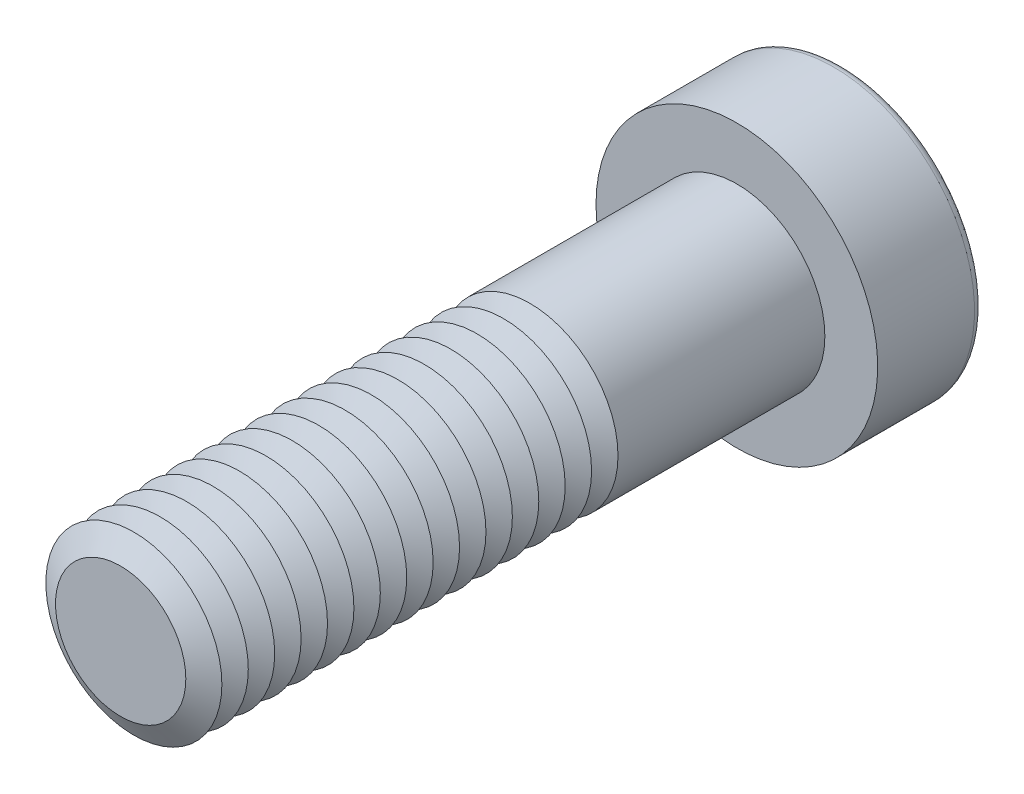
from build123d import *

# Parameters (mm, degrees)
SKETCH1_R           = 5
BOSS_EXTRUDE1_DEPTH = 35
SKETCH2_R           = 8
BOSS_EXTRUDE2_DEPTH = 6
CUT_EXTRUDE1_DEPTH  = 5.25
FILLET1_R           = 0.5
LPATTERN1_COUNT     = 16
LPATTERN1_PITCH     = 1.5


with BuildPart() as part:
    # Sketch1 → Boss-Extrude1 (new body)
    with BuildSketch(Plane.XY):
        Circle(SKETCH1_R)
    extrude(amount=BOSS_EXTRUDE1_DEPTH)

    # Sketch2 → Boss-Extrude2 (add)
    with BuildSketch(Plane(origin=(0, 0, 0), x_dir=(-1, 0, 0), z_dir=(0, 0, -1))):
        Circle(SKETCH2_R)
    extrude(amount=BOSS_EXTRUDE2_DEPTH)

    # Sketch3 → Cut-Extrude1 (cut)
    with BuildSketch(Plane(origin=(0, 0, -6), x_dir=(-1, 0, 0), z_dir=(0, 0, -1))):
        Polygon((-2.020725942, 3.5), (-4.041451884, 0), (-2.020725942, -3.5), (2.020725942, -3.5), (4.041451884, 0), (2.020725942, 3.5), align=None)
    extrude(amount=-CUT_EXTRUDE1_DEPTH, mode=Mode.SUBTRACT)

    # Fillet1
    fillet1_edges = [part.edges().sort_by_distance(p)[0] for p in [
        (8, 0, -6),
    ]]
    fillet(fillet1_edges, radius=FILLET1_R)

    # Cut-Extrude2 cone 1 section (on through the dimple's axis) → Cut-Extrude2 (revolve, cut)
    with BuildSketch(Plane(origin=(0, 0, -0.75), x_dir=(0, 1, 0), z_dir=(1, 0, 0))):
        Polygon((0, 0), (3.5, 0), (0, 2.020725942), align=None)
    revolve(axis=Axis((0, 0, -0.75), (0, 0, 1)), mode=Mode.SUBTRACT)

    # Cut-Extrude3 cone 1 section (on through the dimple's axis) → Cut-Extrude3 (revolve, cut)
    with BuildSketch(Plane(origin=(0, 0, -6), x_dir=(0, 1, 0), z_dir=(1, 0, 0))):
        Polygon((0, 0), (4.041451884, 0), (0, 1.082903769), align=None)
    revolve(axis=Axis((0, 0, -6), (0, 0, 1)), mode=Mode.SUBTRACT)

    # Sketch7 → Cut-Revolve1 (revolve, cut)
    with BuildSketch(Plane(origin=(0, 0, 0), x_dir=(0, 0, -1), z_dir=(1, 0, 0)), mode=Mode.PRIVATE) as cut_revolve1_sk:
        Polygon((-35, 3.700961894), (-34.25, 5), (-35.75, 5), align=None)
    cut_revolve1 = revolve(cut_revolve1_sk.sketch.rotate(Axis((0, 0, 35), (0, 0, -1)), 90), axis=Axis((0, 0, 35), (0, 0, -1)), mode=Mode.SUBTRACT)

    # LPattern1: Cut-Revolve1 ×16
    with Locations(*[(0, 0, -i * LPATTERN1_PITCH) for i in range(1, LPATTERN1_COUNT)]):
        add(cut_revolve1, mode=Mode.SUBTRACT)


solid = part.part
